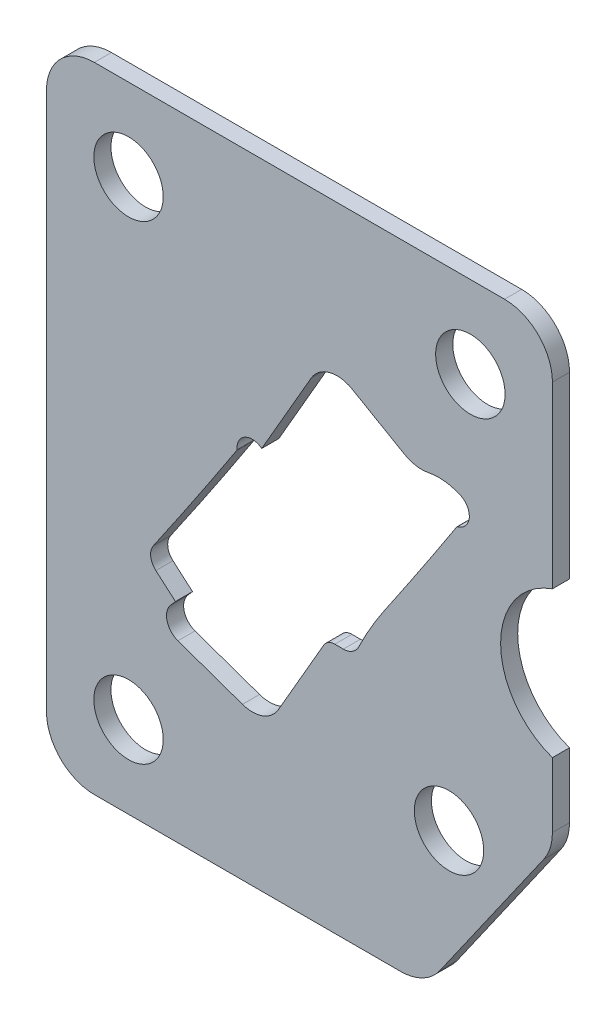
ISO-10303-21;
HEADER;
FILE_DESCRIPTION(('STEP AP214'),'2;1');
FILE_NAME('part.step','',(''),(''),'','','');
FILE_SCHEMA(('AUTOMOTIVE_DESIGN { 1 0 10303 214 1 1 1 1 }'));
ENDSEC;
DATA;
#1=APPLICATION_CONTEXT('core data for automotive mechanical design processes');
#2=APPLICATION_PROTOCOL_DEFINITION('international standard','automotive_design',2000,#1);
#3=PRODUCT_CONTEXT('',#1,'mechanical');
#4=PRODUCT('Part','Part','',(#3));
#5=PRODUCT_RELATED_PRODUCT_CATEGORY('part','',(#4));
#6=PRODUCT_DEFINITION_FORMATION('','',#4);
#7=PRODUCT_DEFINITION_CONTEXT('part definition',#1,'design');
#8=PRODUCT_DEFINITION('design','',#6,#7);
#9=PRODUCT_DEFINITION_SHAPE('','',#8);
#10=(LENGTH_UNIT() NAMED_UNIT(*) SI_UNIT(.MILLI.,.METRE.));
#11=(NAMED_UNIT(*) PLANE_ANGLE_UNIT() SI_UNIT($,.RADIAN.));
#12=(NAMED_UNIT(*) SI_UNIT($,.STERADIAN.) SOLID_ANGLE_UNIT());
#13=UNCERTAINTY_MEASURE_WITH_UNIT(LENGTH_MEASURE(1.E-05),#10,'distance_accuracy_value','');
#14=(GEOMETRIC_REPRESENTATION_CONTEXT(3) GLOBAL_UNCERTAINTY_ASSIGNED_CONTEXT((#13)) GLOBAL_UNIT_ASSIGNED_CONTEXT((#10,
#11,#12)) REPRESENTATION_CONTEXT('',''));
#15=CARTESIAN_POINT('',(0.,0.,0.));
#16=DIRECTION('',(0.,0.,1.));
#17=DIRECTION('',(1.,0.,0.));
#18=AXIS2_PLACEMENT_3D('',#15,#16,#17);
#19=CARTESIAN_POINT('',(-1055.37,51.4350000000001,-31.75));
#20=DIRECTION('',(0.,0.,1.));
#21=DIRECTION('',(1.,0.,0.));
#22=AXIS2_PLACEMENT_3D('',#19,#20,#21);
#23=PLANE('',#22);
#24=CARTESIAN_POINT('',(-1111.25,-23.4949999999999,-31.75));
#25=DIRECTION('',(0.,0.,1.));
#26=DIRECTION('',(1.,0.,0.));
#27=AXIS2_PLACEMENT_3D('',#24,#25,#26);
#28=CIRCLE('',#27,5.15620000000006);
#29=CARTESIAN_POINT('',(-1106.0938,-23.4949999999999,-31.75));
#30=VERTEX_POINT('',#29);
#31=EDGE_CURVE('E537',#30,#30,#28,.T.);
#32=ORIENTED_EDGE('',*,*,#31,.T.);
#33=EDGE_LOOP('',(#32));
#34=FACE_BOUND('',#33,.T.);
#35=CARTESIAN_POINT('',(-1063.625,-13.9699999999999,-31.75));
#36=DIRECTION('',(0.,0.,1.));
#37=DIRECTION('',(1.,0.,0.));
#38=AXIS2_PLACEMENT_3D('',#35,#36,#37);
#39=CIRCLE('',#38,5.15620000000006);
#40=CARTESIAN_POINT('',(-1058.4688,-13.9699999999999,-31.75));
#41=VERTEX_POINT('',#40);
#42=EDGE_CURVE('E545',#41,#41,#39,.T.);
#43=ORIENTED_EDGE('',*,*,#42,.T.);
#44=EDGE_LOOP('',(#43));
#45=FACE_BOUND('',#44,.T.);
#46=CARTESIAN_POINT('',(-1060.45,46.3550000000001,-31.75));
#47=DIRECTION('',(0.,0.,1.));
#48=DIRECTION('',(1.,0.,0.));
#49=AXIS2_PLACEMENT_3D('',#46,#47,#48);
#50=CIRCLE('',#49,5.15620000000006);
#51=CARTESIAN_POINT('',(-1055.2938,46.3550000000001,-31.75));
#52=VERTEX_POINT('',#51);
#53=EDGE_CURVE('E553',#52,#52,#50,.T.);
#54=ORIENTED_EDGE('',*,*,#53,.T.);
#55=EDGE_LOOP('',(#54));
#56=FACE_BOUND('',#55,.T.);
#57=CARTESIAN_POINT('',(-1111.25,46.3550000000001,-31.75));
#58=DIRECTION('',(0.,0.,1.));
#59=DIRECTION('',(1.,0.,0.));
#60=AXIS2_PLACEMENT_3D('',#57,#58,#59);
#61=CIRCLE('',#60,5.15620000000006);
#62=CARTESIAN_POINT('',(-1106.0938,46.3550000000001,-31.75));
#63=VERTEX_POINT('',#62);
#64=EDGE_CURVE('E561',#63,#63,#61,.T.);
#65=ORIENTED_EDGE('',*,*,#64,.T.);
#66=EDGE_LOOP('',(#65));
#67=FACE_BOUND('',#66,.T.);
#68=DIRECTION('',(0.,1.,0.));
#69=VECTOR('',#68,1.);
#70=CARTESIAN_POINT('',(-1048.258,-6.53371920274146,-31.75));
#71=LINE('',#70,#69);
#72=CARTESIAN_POINT('',(-1048.258,24.8304609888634,-31.75));
#73=VERTEX_POINT('',#72);
#74=CARTESIAN_POINT('',(-1048.258,51.435,-31.75));
#75=VERTEX_POINT('',#74);
#76=EDGE_CURVE('E616',#73,#75,#71,.T.);
#77=ORIENTED_EDGE('',*,*,#76,.F.);
#78=CARTESIAN_POINT('',(-1044.448,13.9700000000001,-31.75));
#79=DIRECTION('',(0.,0.,1.));
#80=DIRECTION('',(1.,0.,0.));
#81=AXIS2_PLACEMENT_3D('',#78,#79,#80);
#82=CIRCLE('',#81,11.509375);
#83=CARTESIAN_POINT('',(-1048.258,3.10953901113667,-31.75));
#84=VERTEX_POINT('',#83);
#85=EDGE_CURVE('E566',#73,#84,#82,.T.);
#86=ORIENTED_EDGE('',*,*,#85,.T.);
#87=CARTESIAN_POINT('',(-1048.258,-6.53371920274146,-31.75));
#88=VERTEX_POINT('',#87);
#89=EDGE_CURVE('E617',#88,#84,#71,.T.);
#90=ORIENTED_EDGE('',*,*,#89,.F.);
#91=CARTESIAN_POINT('',(-1055.37,-6.53371920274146,-31.75));
#92=DIRECTION('',(0.,0.,1.));
#93=DIRECTION('',(1.,0.,0.));
#94=AXIS2_PLACEMENT_3D('',#91,#92,#93);
#95=CIRCLE('',#94,7.11200000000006);
#96=CARTESIAN_POINT('',(-1049.54419066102,-10.6129948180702,-31.75));
#97=VERTEX_POINT('',#96);
#98=EDGE_CURVE('E612',#97,#88,#95,.T.);
#99=ORIENTED_EDGE('',*,*,#98,.F.);
#100=DIRECTION('',(0.573576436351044,0.819152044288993,0.));
#101=VECTOR('',#100,1.);
#102=CARTESIAN_POINT('',(-1064.97766162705,-32.6542756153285,-31.75));
#103=LINE('',#102,#101);
#104=CARTESIAN_POINT('',(-1064.97766162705,-32.6542756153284,-31.75));
#105=VERTEX_POINT('',#104);
#106=EDGE_CURVE('E608',#105,#97,#103,.T.);
#107=ORIENTED_EDGE('',*,*,#106,.F.);
#108=CARTESIAN_POINT('',(-1070.80347096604,-28.5749999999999,-31.75));
#109=DIRECTION('',(0.,0.,1.));
#110=DIRECTION('',(1.,0.,0.));
#111=AXIS2_PLACEMENT_3D('',#108,#109,#110);
#112=CIRCLE('',#111,7.11200000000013);
#113=CARTESIAN_POINT('',(-1070.80347096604,-35.687,-31.75));
#114=VERTEX_POINT('',#113);
#115=EDGE_CURVE('E604',#114,#105,#112,.T.);
#116=ORIENTED_EDGE('',*,*,#115,.F.);
#117=DIRECTION('',(1.,0.,0.));
#118=VECTOR('',#117,1.);
#119=CARTESIAN_POINT('',(-1116.33,-35.6869999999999,-31.75));
#120=LINE('',#119,#118);
#121=CARTESIAN_POINT('',(-1116.33,-35.6869999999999,-31.75));
#122=VERTEX_POINT('',#121);
#123=EDGE_CURVE('E600',#122,#114,#120,.T.);
#124=ORIENTED_EDGE('',*,*,#123,.F.);
#125=CARTESIAN_POINT('',(-1116.33,-28.5749999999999,-31.75));
#126=DIRECTION('',(0.,0.,1.));
#127=DIRECTION('',(1.,0.,0.));
#128=AXIS2_PLACEMENT_3D('',#125,#126,#127);
#129=CIRCLE('',#128,7.11199999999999);
#130=CARTESIAN_POINT('',(-1123.442,-28.5749999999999,-31.75));
#131=VERTEX_POINT('',#130);
#132=EDGE_CURVE('E596',#131,#122,#129,.T.);
#133=ORIENTED_EDGE('',*,*,#132,.F.);
#134=DIRECTION('',(0.,-1.,0.));
#135=VECTOR('',#134,1.);
#136=CARTESIAN_POINT('',(-1123.442,51.435,-31.75));
#137=LINE('',#136,#135);
#138=CARTESIAN_POINT('',(-1123.442,51.435,-31.75));
#139=VERTEX_POINT('',#138);
#140=EDGE_CURVE('E592',#139,#131,#137,.T.);
#141=ORIENTED_EDGE('',*,*,#140,.F.);
#142=CARTESIAN_POINT('',(-1116.33,51.4350000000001,-31.75));
#143=DIRECTION('',(0.,0.,1.));
#144=DIRECTION('',(1.,0.,0.));
#145=AXIS2_PLACEMENT_3D('',#142,#143,#144);
#146=CIRCLE('',#145,7.112);
#147=CARTESIAN_POINT('',(-1116.33,58.5470000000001,-31.75));
#148=VERTEX_POINT('',#147);
#149=EDGE_CURVE('E588',#148,#139,#146,.T.);
#150=ORIENTED_EDGE('',*,*,#149,.F.);
#151=DIRECTION('',(-1.,0.,0.));
#152=VECTOR('',#151,1.);
#153=CARTESIAN_POINT('',(-1055.37,58.5470000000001,-31.75));
#154=LINE('',#153,#152);
#155=CARTESIAN_POINT('',(-1055.37,58.5470000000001,-31.75));
#156=VERTEX_POINT('',#155);
#157=EDGE_CURVE('E583',#156,#148,#154,.T.);
#158=ORIENTED_EDGE('',*,*,#157,.F.);
#159=CARTESIAN_POINT('',(-1055.37,51.4350000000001,-31.75));
#160=DIRECTION('',(0.,0.,1.));
#161=DIRECTION('',(1.,0.,0.));
#162=AXIS2_PLACEMENT_3D('',#159,#160,#161);
#163=CIRCLE('',#162,7.112);
#164=EDGE_CURVE('E579',#75,#156,#163,.T.);
#165=ORIENTED_EDGE('',*,*,#164,.F.);
#166=EDGE_LOOP('',(#77,#86,#90,#99,#107,#116,#124,#133,#141,#150,#158,#165));
#167=FACE_BOUND('',#166,.T.);
#168=DIRECTION('',(-0.500000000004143,-0.866025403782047,0.));
#169=VECTOR('',#168,1.);
#170=CARTESIAN_POINT('',(-1084.10623761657,34.0288101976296,-31.75));
#171=LINE('',#170,#169);
#172=CARTESIAN_POINT('',(-1084.10623761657,34.0288101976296,-31.75));
#173=VERTEX_POINT('',#172);
#174=CARTESIAN_POINT('',(-1091.45990883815,21.2918780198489,-31.75));
#175=VERTEX_POINT('',#174);
#176=EDGE_CURVE('E286',#173,#175,#171,.T.);
#177=ORIENTED_EDGE('',*,*,#176,.T.);
#178=CARTESIAN_POINT('',(-1092.86886531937,19.5120629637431,-31.75));
#179=DIRECTION('',(0.,0.,1.));
#180=DIRECTION('',(1.,0.,0.));
#181=AXIS2_PLACEMENT_3D('',#178,#179,#180);
#182=CIRCLE('',#181,2.26999999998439);
#183=CARTESIAN_POINT('',(-1095.13235073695,19.3402090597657,-31.75));
#184=VERTEX_POINT('',#183);
#185=EDGE_CURVE('E279',#175,#184,#182,.T.);
#186=ORIENTED_EDGE('',*,*,#185,.T.);
#187=CARTESIAN_POINT('',(-1095.38562179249,19.3209795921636,-31.75));
#188=DIRECTION('',(0.,0.,-1.));
#189=DIRECTION('',(1.,0.,0.));
#190=AXIS2_PLACEMENT_3D('',#187,#188,#189);
#191=CIRCLE('',#190,0.254000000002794);
#192=CARTESIAN_POINT('',(-1095.1729117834,19.1821615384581,-31.75));
#193=VERTEX_POINT('',#192);
#194=EDGE_CURVE('E289',#184,#193,#191,.T.);
#195=ORIENTED_EDGE('',*,*,#194,.T.);
#196=CARTESIAN_POINT('',(-1812.92046147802,487.596028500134,-31.75));
#197=DIRECTION('',(0.,0.,-1.));
#198=DIRECTION('',(1.,0.,0.));
#199=AXIS2_PLACEMENT_3D('',#196,#197,#198);
#200=CIRCLE('',#199,857.072398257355);
#201=CARTESIAN_POINT('',(-1107.56637726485,0.719543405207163,-31.75));
#202=VERTEX_POINT('',#201);
#203=EDGE_CURVE('E65',#193,#202,#200,.T.);
#204=ORIENTED_EDGE('',*,*,#203,.T.);
#205=CARTESIAN_POINT('',(-1105.69821096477,-0.56997382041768,-31.75));
#206=DIRECTION('',(0.,0.,1.));
#207=DIRECTION('',(1.,0.,0.));
#208=AXIS2_PLACEMENT_3D('',#205,#206,#207);
#209=CIRCLE('',#208,2.26999999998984);
#210=CARTESIAN_POINT('',(-1107.18662755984,-2.28389214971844,-31.75));
#211=VERTEX_POINT('',#210);
#212=EDGE_CURVE('E307',#202,#211,#209,.T.);
#213=ORIENTED_EDGE('',*,*,#212,.T.);
#214=DIRECTION('',(0.755030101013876,-0.655690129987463,0.));
#215=VECTOR('',#214,1.);
#216=CARTESIAN_POINT('',(-1107.18662755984,-2.28389214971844,-31.75));
#217=LINE('',#216,#215);
#218=CARTESIAN_POINT('',(-1104.27812448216,-4.8097209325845,-31.75));
#219=VERTEX_POINT('',#218);
#220=EDGE_CURVE('E311',#211,#219,#217,.T.);
#221=ORIENTED_EDGE('',*,*,#220,.T.);
#222=DIRECTION('',(-0.655690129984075,-0.755030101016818,0.));
#223=VECTOR('',#222,1.);
#224=CARTESIAN_POINT('',(-1104.27812448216,-4.8097209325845,-31.75));
#225=LINE('',#224,#223);
#226=CARTESIAN_POINT('',(-1104.98152565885,-5.61969051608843,-31.75));
#227=VERTEX_POINT('',#226);
#228=EDGE_CURVE('E315',#219,#227,#225,.T.);
#229=ORIENTED_EDGE('',*,*,#228,.T.);
#230=CARTESIAN_POINT('',(-1103.06374920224,-7.285143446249,-31.75));
#231=DIRECTION('',(0.,0.,1.));
#232=DIRECTION('',(1.,0.,0.));
#233=AXIS2_PLACEMENT_3D('',#230,#231,#232);
#234=CIRCLE('',#233,2.54000000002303);
#235=CARTESIAN_POINT('',(-1103.90810029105,-9.68069583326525,-31.75));
#236=VERTEX_POINT('',#235);
#237=EDGE_CURVE('E319',#227,#236,#234,.T.);
#238=ORIENTED_EDGE('',*,*,#237,.T.);
#239=DIRECTION('',(0.943130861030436,-0.332421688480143,0.));
#240=VECTOR('',#239,1.);
#241=CARTESIAN_POINT('',(-1103.90810029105,-9.68069583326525,-31.75));
#242=LINE('',#241,#240);
#243=CARTESIAN_POINT('',(-1094.31656153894,-13.0613884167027,-31.75));
#244=VERTEX_POINT('',#243);
#245=EDGE_CURVE('E323',#236,#244,#242,.T.);
#246=ORIENTED_EDGE('',*,*,#245,.T.);
#247=CARTESIAN_POINT('',(-1092.83894713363,-8.86917173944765,-31.75));
#248=DIRECTION('',(0.,0.,1.));
#249=DIRECTION('',(1.,0.,0.));
#250=AXIS2_PLACEMENT_3D('',#247,#248,#249);
#251=CIRCLE('',#250,4.44499999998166);
#252=CARTESIAN_POINT('',(-1088.98946421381,-11.0916717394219,-31.75));
#253=VERTEX_POINT('',#252);
#254=EDGE_CURVE('E327',#244,#253,#251,.T.);
#255=ORIENTED_EDGE('',*,*,#254,.T.);
#256=DIRECTION('',(0.499999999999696,0.866025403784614,0.));
#257=VECTOR('',#256,1.);
#258=CARTESIAN_POINT('',(-1088.98946421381,-11.0916717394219,-31.75));
#259=LINE('',#258,#257);
#260=CARTESIAN_POINT('',(-1082.24588369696,0.588552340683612,-31.75));
#261=VERTEX_POINT('',#260);
#262=EDGE_CURVE('E331',#253,#261,#259,.T.);
#263=ORIENTED_EDGE('',*,*,#262,.T.);
#264=CARTESIAN_POINT('',(-1080.59610530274,-0.363947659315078,-31.75));
#265=DIRECTION('',(0.,0.,-1.));
#266=DIRECTION('',(1.,0.,0.));
#267=AXIS2_PLACEMENT_3D('',#264,#265,#266);
#268=CIRCLE('',#267,1.90500000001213);
#269=CARTESIAN_POINT('',(-1080.59610530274,1.54105234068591,-31.75));
#270=VERTEX_POINT('',#269);
#271=EDGE_CURVE('E335',#261,#270,#268,.T.);
#272=ORIENTED_EDGE('',*,*,#271,.T.);
#273=DIRECTION('',(1.,0.,0.));
#274=VECTOR('',#273,1.);
#275=CARTESIAN_POINT('',(-1080.59610530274,1.54105234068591,-31.75));
#276=LINE('',#275,#274);
#277=CARTESIAN_POINT('',(-1079.32610530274,1.54105234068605,-31.75));
#278=VERTEX_POINT('',#277);
#279=EDGE_CURVE('E339',#270,#278,#276,.T.);
#280=ORIENTED_EDGE('',*,*,#279,.T.);
#281=CARTESIAN_POINT('',(-1079.32610530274,4.08105234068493,-31.75));
#282=DIRECTION('',(0.,0.,1.));
#283=DIRECTION('',(1.,0.,0.));
#284=AXIS2_PLACEMENT_3D('',#281,#282,#283);
#285=CIRCLE('',#284,2.53999999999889);
#286=CARTESIAN_POINT('',(-1077.04152238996,2.97097085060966,-31.75));
#287=VERTEX_POINT('',#286);
#288=EDGE_CURVE('E343',#278,#287,#285,.T.);
#289=ORIENTED_EDGE('',*,*,#288,.T.);
#290=CARTESIAN_POINT('',(-1030.09012737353,-19.8427665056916,-31.75));
#291=DIRECTION('',(0.,0.,-1.));
#292=DIRECTION('',(1.,0.,0.));
#293=AXIS2_PLACEMENT_3D('',#290,#291,#292);
#294=CIRCLE('',#293,52.2005757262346);
#295=CARTESIAN_POINT('',(-1073.3997555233,9.29786175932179,-31.75));
#296=VERTEX_POINT('',#295);
#297=EDGE_CURVE('E347',#287,#296,#294,.T.);
#298=ORIENTED_EDGE('',*,*,#297,.T.);
#299=CARTESIAN_POINT('',(-1773.16946147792,487.596028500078,-31.75));
#300=DIRECTION('',(0.,0.,1.));
#301=DIRECTION('',(1.,0.,0.));
#302=AXIS2_PLACEMENT_3D('',#299,#300,#301);
#303=CIRCLE('',#302,847.612398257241);
#304=CARTESIAN_POINT('',(-1062.48289720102,25.6746228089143,-31.75));
#305=VERTEX_POINT('',#304);
#306=EDGE_CURVE('E351',#296,#305,#303,.T.);
#307=ORIENTED_EDGE('',*,*,#306,.T.);
#308=CARTESIAN_POINT('',(-1062.26992911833,25.5362010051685,-31.75));
#309=DIRECTION('',(0.,0.,-1.));
#310=DIRECTION('',(1.,0.,0.));
#311=AXIS2_PLACEMENT_3D('',#308,#309,#310);
#312=CIRCLE('',#311,0.253999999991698);
#313=CARTESIAN_POINT('',(-1062.33092433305,25.7827686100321,-31.75));
#314=VERTEX_POINT('',#313);
#315=EDGE_CURVE('E355',#305,#314,#312,.T.);
#316=ORIENTED_EDGE('',*,*,#315,.T.);
#317=CARTESIAN_POINT('',(-1062.8760390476,27.9863452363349,-31.75));
#318=DIRECTION('',(0.,0.,1.));
#319=DIRECTION('',(1.,0.,0.));
#320=AXIS2_PLACEMENT_3D('',#317,#318,#319);
#321=CIRCLE('',#320,2.26999999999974);
#322=CARTESIAN_POINT('',(-1062.12144181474,30.1272522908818,-31.75));
#323=VERTEX_POINT('',#322);
#324=EDGE_CURVE('E359',#314,#323,#321,.T.);
#325=ORIENTED_EDGE('',*,*,#324,.T.);
#326=DIRECTION('',(-0.943130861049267,0.332421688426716,0.));
#327=VECTOR('',#326,1.);
#328=CARTESIAN_POINT('',(-1062.12144181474,30.1272522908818,-31.75));
#329=LINE('',#328,#327);
#330=CARTESIAN_POINT('',(-1062.60055229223,30.2961225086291,-31.75));
#331=VERTEX_POINT('',#330);
#332=EDGE_CURVE('E363',#323,#331,#329,.T.);
#333=ORIENTED_EDGE('',*,*,#332,.T.);
#334=CARTESIAN_POINT('',(-1065.13360555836,23.109465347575,-31.75));
#335=DIRECTION('',(0.,0.,1.));
#336=DIRECTION('',(1.,0.,0.));
#337=AXIS2_PLACEMENT_3D('',#334,#335,#336);
#338=CIRCLE('',#337,7.61999999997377);
#339=CARTESIAN_POINT('',(-1066.66752029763,30.5734793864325,-31.75));
#340=VERTEX_POINT('',#339);
#341=EDGE_CURVE('E367',#331,#340,#338,.T.);
#342=ORIENTED_EDGE('',*,*,#341,.T.);
#343=CARTESIAN_POINT('',(-1067.69013012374,35.5494887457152,-31.75));
#344=DIRECTION('',(0.,0.,-1.));
#345=DIRECTION('',(1.,0.,0.));
#346=AXIS2_PLACEMENT_3D('',#343,#344,#345);
#347=CIRCLE('',#346,5.08000000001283);
#348=CARTESIAN_POINT('',(-1070.23013012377,31.1500796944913,-31.75));
#349=VERTEX_POINT('',#348);
#350=EDGE_CURVE('E371',#340,#349,#347,.T.);
#351=ORIENTED_EDGE('',*,*,#350,.T.);
#352=DIRECTION('',(-0.866025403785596,0.499999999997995,0.));
#353=VECTOR('',#352,1.);
#354=CARTESIAN_POINT('',(-1070.23013012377,31.1500796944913,-31.75));
#355=LINE('',#354,#353);
#356=CARTESIAN_POINT('',(-1078.0342546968,35.6557931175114,-31.75));
#357=VERTEX_POINT('',#356);
#358=EDGE_CURVE('E375',#349,#357,#355,.T.);
#359=ORIENTED_EDGE('',*,*,#358,.T.);
#360=CARTESIAN_POINT('',(-1080.25675469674,31.806310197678,-31.75));
#361=DIRECTION('',(0.,0.,1.));
#362=DIRECTION('',(1.,0.,0.));
#363=AXIS2_PLACEMENT_3D('',#360,#361,#362);
#364=CIRCLE('',#363,4.44499999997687);
#365=EDGE_CURVE('E379',#357,#173,#364,.T.);
#366=ORIENTED_EDGE('',*,*,#365,.T.);
#367=EDGE_LOOP('',(#177,#186,#195,#204,#213,#221,#229,#238,#246,#255,#263,#272,#280,#289,#298,
#307,#316,#325,#333,#342,#351,#359,#366));
#368=FACE_BOUND('',#367,.T.);
#369=ADVANCED_FACE('F47',(#34,#45,#56,#67,#167,#368),#23,.F.);
#370=CARTESIAN_POINT('',(-1055.37,51.4350000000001,-29.21));
#371=DIRECTION('',(0.,0.,1.));
#372=DIRECTION('',(1.,0.,0.));
#373=AXIS2_PLACEMENT_3D('',#370,#371,#372);
#374=PLANE('',#373);
#375=CARTESIAN_POINT('',(-1044.448,13.9700000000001,-29.21));
#376=DIRECTION('',(0.,0.,1.));
#377=DIRECTION('',(1.,0.,0.));
#378=AXIS2_PLACEMENT_3D('',#375,#376,#377);
#379=CIRCLE('',#378,11.509375);
#380=CARTESIAN_POINT('',(-1048.258,24.8304609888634,-29.21));
#381=VERTEX_POINT('',#380);
#382=CARTESIAN_POINT('',(-1048.258,3.10953901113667,-29.21));
#383=VERTEX_POINT('',#382);
#384=EDGE_CURVE('E565',#381,#383,#379,.T.);
#385=ORIENTED_EDGE('',*,*,#384,.F.);
#386=DIRECTION('',(0.,1.,0.));
#387=VECTOR('',#386,1.);
#388=CARTESIAN_POINT('',(-1048.258,-6.53371920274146,-29.21));
#389=LINE('',#388,#387);
#390=CARTESIAN_POINT('',(-1048.258,51.435,-29.21));
#391=VERTEX_POINT('',#390);
#392=EDGE_CURVE('E656',#381,#391,#389,.T.);
#393=ORIENTED_EDGE('',*,*,#392,.T.);
#394=CARTESIAN_POINT('',(-1055.37,51.4350000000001,-29.21));
#395=DIRECTION('',(0.,0.,1.));
#396=DIRECTION('',(1.,0.,0.));
#397=AXIS2_PLACEMENT_3D('',#394,#395,#396);
#398=CIRCLE('',#397,7.112);
#399=CARTESIAN_POINT('',(-1055.37,58.5470000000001,-29.21));
#400=VERTEX_POINT('',#399);
#401=EDGE_CURVE('E578',#391,#400,#398,.T.);
#402=ORIENTED_EDGE('',*,*,#401,.T.);
#403=DIRECTION('',(-1.,0.,0.));
#404=VECTOR('',#403,1.);
#405=CARTESIAN_POINT('',(-1055.37,58.5470000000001,-29.21));
#406=LINE('',#405,#404);
#407=CARTESIAN_POINT('',(-1116.33,58.5470000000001,-29.21));
#408=VERTEX_POINT('',#407);
#409=EDGE_CURVE('E624',#400,#408,#406,.T.);
#410=ORIENTED_EDGE('',*,*,#409,.T.);
#411=CARTESIAN_POINT('',(-1116.33,51.4350000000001,-29.21));
#412=DIRECTION('',(0.,0.,1.));
#413=DIRECTION('',(1.,0.,0.));
#414=AXIS2_PLACEMENT_3D('',#411,#412,#413);
#415=CIRCLE('',#414,7.112);
#416=CARTESIAN_POINT('',(-1123.442,51.435,-29.21));
#417=VERTEX_POINT('',#416);
#418=EDGE_CURVE('E628',#408,#417,#415,.T.);
#419=ORIENTED_EDGE('',*,*,#418,.T.);
#420=DIRECTION('',(0.,-1.,0.));
#421=VECTOR('',#420,1.);
#422=CARTESIAN_POINT('',(-1123.442,51.435,-29.21));
#423=LINE('',#422,#421);
#424=CARTESIAN_POINT('',(-1123.442,-28.5749999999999,-29.21));
#425=VERTEX_POINT('',#424);
#426=EDGE_CURVE('E632',#417,#425,#423,.T.);
#427=ORIENTED_EDGE('',*,*,#426,.T.);
#428=CARTESIAN_POINT('',(-1116.33,-28.5749999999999,-29.21));
#429=DIRECTION('',(0.,0.,1.));
#430=DIRECTION('',(1.,0.,0.));
#431=AXIS2_PLACEMENT_3D('',#428,#429,#430);
#432=CIRCLE('',#431,7.11199999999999);
#433=CARTESIAN_POINT('',(-1116.33,-35.6869999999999,-29.21));
#434=VERTEX_POINT('',#433);
#435=EDGE_CURVE('E636',#425,#434,#432,.T.);
#436=ORIENTED_EDGE('',*,*,#435,.T.);
#437=DIRECTION('',(1.,0.,0.));
#438=VECTOR('',#437,1.);
#439=CARTESIAN_POINT('',(-1116.33,-35.6869999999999,-29.21));
#440=LINE('',#439,#438);
#441=CARTESIAN_POINT('',(-1070.80347096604,-35.687,-29.21));
#442=VERTEX_POINT('',#441);
#443=EDGE_CURVE('E640',#434,#442,#440,.T.);
#444=ORIENTED_EDGE('',*,*,#443,.T.);
#445=CARTESIAN_POINT('',(-1070.80347096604,-28.5749999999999,-29.21));
#446=DIRECTION('',(0.,0.,1.));
#447=DIRECTION('',(1.,0.,0.));
#448=AXIS2_PLACEMENT_3D('',#445,#446,#447);
#449=CIRCLE('',#448,7.11200000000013);
#450=CARTESIAN_POINT('',(-1064.97766162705,-32.6542756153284,-29.21));
#451=VERTEX_POINT('',#450);
#452=EDGE_CURVE('E644',#442,#451,#449,.T.);
#453=ORIENTED_EDGE('',*,*,#452,.T.);
#454=DIRECTION('',(0.573576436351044,0.819152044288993,0.));
#455=VECTOR('',#454,1.);
#456=CARTESIAN_POINT('',(-1064.97766162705,-32.6542756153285,-29.21));
#457=LINE('',#456,#455);
#458=CARTESIAN_POINT('',(-1049.54419066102,-10.6129948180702,-29.21));
#459=VERTEX_POINT('',#458);
#460=EDGE_CURVE('E648',#451,#459,#457,.T.);
#461=ORIENTED_EDGE('',*,*,#460,.T.);
#462=CARTESIAN_POINT('',(-1055.37,-6.53371920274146,-29.21));
#463=DIRECTION('',(0.,0.,1.));
#464=DIRECTION('',(1.,0.,0.));
#465=AXIS2_PLACEMENT_3D('',#462,#463,#464);
#466=CIRCLE('',#465,7.11200000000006);
#467=CARTESIAN_POINT('',(-1048.258,-6.53371920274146,-29.21));
#468=VERTEX_POINT('',#467);
#469=EDGE_CURVE('E652',#459,#468,#466,.T.);
#470=ORIENTED_EDGE('',*,*,#469,.T.);
#471=EDGE_CURVE('E584',#468,#383,#389,.T.);
#472=ORIENTED_EDGE('',*,*,#471,.T.);
#473=EDGE_LOOP('',(#385,#393,#402,#410,#419,#427,#436,#444,#453,#461,#470,#472));
#474=FACE_BOUND('',#473,.T.);
#475=CARTESIAN_POINT('',(-1111.25,46.3550000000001,-29.21));
#476=DIRECTION('',(0.,0.,1.));
#477=DIRECTION('',(1.,0.,0.));
#478=AXIS2_PLACEMENT_3D('',#475,#476,#477);
#479=CIRCLE('',#478,5.15620000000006);
#480=CARTESIAN_POINT('',(-1106.0938,46.3550000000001,-29.21));
#481=VERTEX_POINT('',#480);
#482=EDGE_CURVE('E557',#481,#481,#479,.T.);
#483=ORIENTED_EDGE('',*,*,#482,.F.);
#484=EDGE_LOOP('',(#483));
#485=FACE_BOUND('',#484,.T.);
#486=CARTESIAN_POINT('',(-1060.45,46.3550000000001,-29.21));
#487=DIRECTION('',(0.,0.,1.));
#488=DIRECTION('',(1.,0.,0.));
#489=AXIS2_PLACEMENT_3D('',#486,#487,#488);
#490=CIRCLE('',#489,5.15620000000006);
#491=CARTESIAN_POINT('',(-1055.2938,46.3550000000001,-29.21));
#492=VERTEX_POINT('',#491);
#493=EDGE_CURVE('E549',#492,#492,#490,.T.);
#494=ORIENTED_EDGE('',*,*,#493,.F.);
#495=EDGE_LOOP('',(#494));
#496=FACE_BOUND('',#495,.T.);
#497=CARTESIAN_POINT('',(-1063.625,-13.9699999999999,-29.21));
#498=DIRECTION('',(0.,0.,1.));
#499=DIRECTION('',(1.,0.,0.));
#500=AXIS2_PLACEMENT_3D('',#497,#498,#499);
#501=CIRCLE('',#500,5.15620000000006);
#502=CARTESIAN_POINT('',(-1058.4688,-13.9699999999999,-29.21));
#503=VERTEX_POINT('',#502);
#504=EDGE_CURVE('E541',#503,#503,#501,.T.);
#505=ORIENTED_EDGE('',*,*,#504,.F.);
#506=EDGE_LOOP('',(#505));
#507=FACE_BOUND('',#506,.T.);
#508=CARTESIAN_POINT('',(-1111.25,-23.4949999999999,-29.21));
#509=DIRECTION('',(0.,0.,1.));
#510=DIRECTION('',(1.,0.,0.));
#511=AXIS2_PLACEMENT_3D('',#508,#509,#510);
#512=CIRCLE('',#511,5.15620000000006);
#513=CARTESIAN_POINT('',(-1106.0938,-23.4949999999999,-29.21));
#514=VERTEX_POINT('',#513);
#515=EDGE_CURVE('E471',#514,#514,#512,.T.);
#516=ORIENTED_EDGE('',*,*,#515,.F.);
#517=EDGE_LOOP('',(#516));
#518=FACE_BOUND('',#517,.T.);
#519=CARTESIAN_POINT('',(-1092.86886531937,19.5120629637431,-29.21));
#520=DIRECTION('',(0.,0.,1.));
#521=DIRECTION('',(1.,0.,0.));
#522=AXIS2_PLACEMENT_3D('',#519,#520,#521);
#523=CIRCLE('',#522,2.26999999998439);
#524=CARTESIAN_POINT('',(-1091.45990883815,21.2918780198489,-29.21));
#525=VERTEX_POINT('',#524);
#526=CARTESIAN_POINT('',(-1095.13235073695,19.3402090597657,-29.21));
#527=VERTEX_POINT('',#526);
#528=EDGE_CURVE('E73',#525,#527,#523,.T.);
#529=ORIENTED_EDGE('',*,*,#528,.F.);
#530=DIRECTION('',(-0.500000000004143,-0.866025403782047,0.));
#531=VECTOR('',#530,1.);
#532=CARTESIAN_POINT('',(-1084.10623761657,34.0288101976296,-29.21));
#533=LINE('',#532,#531);
#534=CARTESIAN_POINT('',(-1084.10623761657,34.0288101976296,-29.21));
#535=VERTEX_POINT('',#534);
#536=EDGE_CURVE('E297',#535,#525,#533,.T.);
#537=ORIENTED_EDGE('',*,*,#536,.F.);
#538=CARTESIAN_POINT('',(-1080.25675469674,31.806310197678,-29.21));
#539=DIRECTION('',(0.,0.,1.));
#540=DIRECTION('',(1.,0.,0.));
#541=AXIS2_PLACEMENT_3D('',#538,#539,#540);
#542=CIRCLE('',#541,4.44499999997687);
#543=CARTESIAN_POINT('',(-1078.0342546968,35.6557931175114,-29.21));
#544=VERTEX_POINT('',#543);
#545=EDGE_CURVE('E302',#544,#535,#542,.T.);
#546=ORIENTED_EDGE('',*,*,#545,.F.);
#547=DIRECTION('',(-0.866025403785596,0.499999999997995,0.));
#548=VECTOR('',#547,1.);
#549=CARTESIAN_POINT('',(-1070.23013012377,31.1500796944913,-29.21));
#550=LINE('',#549,#548);
#551=CARTESIAN_POINT('',(-1070.23013012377,31.1500796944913,-29.21));
#552=VERTEX_POINT('',#551);
#553=EDGE_CURVE('E461',#552,#544,#550,.T.);
#554=ORIENTED_EDGE('',*,*,#553,.F.);
#555=CARTESIAN_POINT('',(-1067.69013012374,35.5494887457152,-29.21));
#556=DIRECTION('',(0.,0.,-1.));
#557=DIRECTION('',(1.,0.,0.));
#558=AXIS2_PLACEMENT_3D('',#555,#556,#557);
#559=CIRCLE('',#558,5.08000000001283);
#560=CARTESIAN_POINT('',(-1066.66752029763,30.5734793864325,-29.21));
#561=VERTEX_POINT('',#560);
#562=EDGE_CURVE('E457',#561,#552,#559,.T.);
#563=ORIENTED_EDGE('',*,*,#562,.F.);
#564=CARTESIAN_POINT('',(-1065.13360555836,23.109465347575,-29.21));
#565=DIRECTION('',(0.,0.,1.));
#566=DIRECTION('',(1.,0.,0.));
#567=AXIS2_PLACEMENT_3D('',#564,#565,#566);
#568=CIRCLE('',#567,7.61999999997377);
#569=CARTESIAN_POINT('',(-1062.60055229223,30.2961225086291,-29.21));
#570=VERTEX_POINT('',#569);
#571=EDGE_CURVE('E453',#570,#561,#568,.T.);
#572=ORIENTED_EDGE('',*,*,#571,.F.);
#573=DIRECTION('',(-0.943130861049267,0.332421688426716,0.));
#574=VECTOR('',#573,1.);
#575=CARTESIAN_POINT('',(-1062.12144181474,30.1272522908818,-29.21));
#576=LINE('',#575,#574);
#577=CARTESIAN_POINT('',(-1062.12144181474,30.1272522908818,-29.21));
#578=VERTEX_POINT('',#577);
#579=EDGE_CURVE('E449',#578,#570,#576,.T.);
#580=ORIENTED_EDGE('',*,*,#579,.F.);
#581=CARTESIAN_POINT('',(-1062.8760390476,27.9863452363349,-29.21));
#582=DIRECTION('',(0.,0.,1.));
#583=DIRECTION('',(1.,0.,0.));
#584=AXIS2_PLACEMENT_3D('',#581,#582,#583);
#585=CIRCLE('',#584,2.26999999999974);
#586=CARTESIAN_POINT('',(-1062.33092433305,25.7827686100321,-29.21));
#587=VERTEX_POINT('',#586);
#588=EDGE_CURVE('E445',#587,#578,#585,.T.);
#589=ORIENTED_EDGE('',*,*,#588,.F.);
#590=CARTESIAN_POINT('',(-1062.26992911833,25.5362010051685,-29.21));
#591=DIRECTION('',(0.,0.,-1.));
#592=DIRECTION('',(1.,0.,0.));
#593=AXIS2_PLACEMENT_3D('',#590,#591,#592);
#594=CIRCLE('',#593,0.253999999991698);
#595=CARTESIAN_POINT('',(-1062.48289720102,25.6746228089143,-29.21));
#596=VERTEX_POINT('',#595);
#597=EDGE_CURVE('E441',#596,#587,#594,.T.);
#598=ORIENTED_EDGE('',*,*,#597,.F.);
#599=CARTESIAN_POINT('',(-1773.16946147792,487.596028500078,-29.21));
#600=DIRECTION('',(0.,0.,1.));
#601=DIRECTION('',(1.,0.,0.));
#602=AXIS2_PLACEMENT_3D('',#599,#600,#601);
#603=CIRCLE('',#602,847.612398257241);
#604=CARTESIAN_POINT('',(-1073.3997555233,9.29786175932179,-29.21));
#605=VERTEX_POINT('',#604);
#606=EDGE_CURVE('E437',#605,#596,#603,.T.);
#607=ORIENTED_EDGE('',*,*,#606,.F.);
#608=CARTESIAN_POINT('',(-1030.09012737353,-19.8427665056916,-29.21));
#609=DIRECTION('',(0.,0.,-1.));
#610=DIRECTION('',(1.,0.,0.));
#611=AXIS2_PLACEMENT_3D('',#608,#609,#610);
#612=CIRCLE('',#611,52.2005757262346);
#613=CARTESIAN_POINT('',(-1077.04152238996,2.97097085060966,-29.21));
#614=VERTEX_POINT('',#613);
#615=EDGE_CURVE('E433',#614,#605,#612,.T.);
#616=ORIENTED_EDGE('',*,*,#615,.F.);
#617=CARTESIAN_POINT('',(-1079.32610530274,4.08105234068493,-29.21));
#618=DIRECTION('',(0.,0.,1.));
#619=DIRECTION('',(1.,0.,0.));
#620=AXIS2_PLACEMENT_3D('',#617,#618,#619);
#621=CIRCLE('',#620,2.53999999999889);
#622=CARTESIAN_POINT('',(-1079.32610530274,1.54105234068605,-29.21));
#623=VERTEX_POINT('',#622);
#624=EDGE_CURVE('E429',#623,#614,#621,.T.);
#625=ORIENTED_EDGE('',*,*,#624,.F.);
#626=DIRECTION('',(1.,0.,0.));
#627=VECTOR('',#626,1.);
#628=CARTESIAN_POINT('',(-1080.59610530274,1.54105234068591,-29.21));
#629=LINE('',#628,#627);
#630=CARTESIAN_POINT('',(-1080.59610530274,1.54105234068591,-29.21));
#631=VERTEX_POINT('',#630);
#632=EDGE_CURVE('E425',#631,#623,#629,.T.);
#633=ORIENTED_EDGE('',*,*,#632,.F.);
#634=CARTESIAN_POINT('',(-1080.59610530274,-0.363947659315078,-29.21));
#635=DIRECTION('',(0.,0.,-1.));
#636=DIRECTION('',(1.,0.,0.));
#637=AXIS2_PLACEMENT_3D('',#634,#635,#636);
#638=CIRCLE('',#637,1.90500000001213);
#639=CARTESIAN_POINT('',(-1082.24588369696,0.588552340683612,-29.21));
#640=VERTEX_POINT('',#639);
#641=EDGE_CURVE('E421',#640,#631,#638,.T.);
#642=ORIENTED_EDGE('',*,*,#641,.F.);
#643=DIRECTION('',(0.499999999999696,0.866025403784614,0.));
#644=VECTOR('',#643,1.);
#645=CARTESIAN_POINT('',(-1088.98946421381,-11.0916717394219,-29.21));
#646=LINE('',#645,#644);
#647=CARTESIAN_POINT('',(-1088.98946421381,-11.0916717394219,-29.21));
#648=VERTEX_POINT('',#647);
#649=EDGE_CURVE('E417',#648,#640,#646,.T.);
#650=ORIENTED_EDGE('',*,*,#649,.F.);
#651=CARTESIAN_POINT('',(-1092.83894713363,-8.86917173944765,-29.21));
#652=DIRECTION('',(0.,0.,1.));
#653=DIRECTION('',(1.,0.,0.));
#654=AXIS2_PLACEMENT_3D('',#651,#652,#653);
#655=CIRCLE('',#654,4.44499999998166);
#656=CARTESIAN_POINT('',(-1094.31656153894,-13.0613884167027,-29.21));
#657=VERTEX_POINT('',#656);
#658=EDGE_CURVE('E413',#657,#648,#655,.T.);
#659=ORIENTED_EDGE('',*,*,#658,.F.);
#660=DIRECTION('',(0.943130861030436,-0.332421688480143,0.));
#661=VECTOR('',#660,1.);
#662=CARTESIAN_POINT('',(-1103.90810029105,-9.68069583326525,-29.21));
#663=LINE('',#662,#661);
#664=CARTESIAN_POINT('',(-1103.90810029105,-9.68069583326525,-29.21));
#665=VERTEX_POINT('',#664);
#666=EDGE_CURVE('E409',#665,#657,#663,.T.);
#667=ORIENTED_EDGE('',*,*,#666,.F.);
#668=CARTESIAN_POINT('',(-1103.06374920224,-7.285143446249,-29.21));
#669=DIRECTION('',(0.,0.,1.));
#670=DIRECTION('',(1.,0.,0.));
#671=AXIS2_PLACEMENT_3D('',#668,#669,#670);
#672=CIRCLE('',#671,2.54000000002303);
#673=CARTESIAN_POINT('',(-1104.98152565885,-5.61969051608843,-29.21));
#674=VERTEX_POINT('',#673);
#675=EDGE_CURVE('E405',#674,#665,#672,.T.);
#676=ORIENTED_EDGE('',*,*,#675,.F.);
#677=DIRECTION('',(-0.655690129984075,-0.755030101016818,0.));
#678=VECTOR('',#677,1.);
#679=CARTESIAN_POINT('',(-1104.27812448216,-4.8097209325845,-29.21));
#680=LINE('',#679,#678);
#681=CARTESIAN_POINT('',(-1104.27812448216,-4.8097209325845,-29.21));
#682=VERTEX_POINT('',#681);
#683=EDGE_CURVE('E401',#682,#674,#680,.T.);
#684=ORIENTED_EDGE('',*,*,#683,.F.);
#685=DIRECTION('',(0.755030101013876,-0.655690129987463,0.));
#686=VECTOR('',#685,1.);
#687=CARTESIAN_POINT('',(-1107.18662755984,-2.28389214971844,-29.21));
#688=LINE('',#687,#686);
#689=CARTESIAN_POINT('',(-1107.18662755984,-2.28389214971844,-29.21));
#690=VERTEX_POINT('',#689);
#691=EDGE_CURVE('E397',#690,#682,#688,.T.);
#692=ORIENTED_EDGE('',*,*,#691,.F.);
#693=CARTESIAN_POINT('',(-1105.69821096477,-0.56997382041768,-29.21));
#694=DIRECTION('',(0.,0.,1.));
#695=DIRECTION('',(1.,0.,0.));
#696=AXIS2_PLACEMENT_3D('',#693,#694,#695);
#697=CIRCLE('',#696,2.26999999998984);
#698=CARTESIAN_POINT('',(-1107.56637726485,0.719543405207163,-29.21));
#699=VERTEX_POINT('',#698);
#700=EDGE_CURVE('E393',#699,#690,#697,.T.);
#701=ORIENTED_EDGE('',*,*,#700,.F.);
#702=CARTESIAN_POINT('',(-1812.92046147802,487.596028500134,-29.21));
#703=DIRECTION('',(0.,0.,-1.));
#704=DIRECTION('',(1.,0.,0.));
#705=AXIS2_PLACEMENT_3D('',#702,#703,#704);
#706=CIRCLE('',#705,857.072398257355);
#707=CARTESIAN_POINT('',(-1095.1729117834,19.1821615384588,-29.21));
#708=VERTEX_POINT('',#707);
#709=EDGE_CURVE('E389',#708,#699,#706,.T.);
#710=ORIENTED_EDGE('',*,*,#709,.F.);
#711=CARTESIAN_POINT('',(-1095.38562179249,19.3209795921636,-29.21));
#712=DIRECTION('',(0.,0.,-1.));
#713=DIRECTION('',(1.,0.,0.));
#714=AXIS2_PLACEMENT_3D('',#711,#712,#713);
#715=CIRCLE('',#714,0.254000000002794);
#716=EDGE_CURVE('E386',#527,#708,#715,.T.);
#717=ORIENTED_EDGE('',*,*,#716,.F.);
#718=EDGE_LOOP('',(#529,#537,#546,#554,#563,#572,#580,#589,#598,#607,#616,#625,#633,#642,#650,
#659,#667,#676,#684,#692,#701,#710,#717));
#719=FACE_BOUND('',#718,.T.);
#720=ADVANCED_FACE('F695',(#474,#485,#496,#507,#518,#719),#374,.T.);
#721=CARTESIAN_POINT('',(-1048.258,-6.53371920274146,-31.75));
#722=DIRECTION('',(1.,0.,0.));
#723=DIRECTION('',(0.,0.,-1.));
#724=AXIS2_PLACEMENT_3D('',#721,#722,#723);
#725=PLANE('',#724);
#726=DIRECTION('',(0.,0.,1.));
#727=VECTOR('',#726,1.);
#728=CARTESIAN_POINT('',(-1048.258,24.8304609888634,-31.75));
#729=LINE('',#728,#727);
#730=EDGE_CURVE('E575',#73,#381,#729,.T.);
#731=ORIENTED_EDGE('',*,*,#730,.F.);
#732=ORIENTED_EDGE('',*,*,#76,.T.);
#733=DIRECTION('',(0.,0.,1.));
#734=VECTOR('',#733,1.);
#735=CARTESIAN_POINT('',(-1048.258,51.435,-31.75));
#736=LINE('',#735,#734);
#737=EDGE_CURVE('E11',#75,#391,#736,.T.);
#738=ORIENTED_EDGE('',*,*,#737,.T.);
#739=ORIENTED_EDGE('',*,*,#392,.F.);
#740=EDGE_LOOP('',(#731,#732,#738,#739));
#741=FACE_BOUND('',#740,.T.);
#742=ADVANCED_FACE('F701',(#741),#725,.T.);
#743=CARTESIAN_POINT('',(-1055.37,51.4350000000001,-31.75));
#744=DIRECTION('',(0.,0.,1.));
#745=DIRECTION('',(1.,0.,0.));
#746=AXIS2_PLACEMENT_3D('',#743,#744,#745);
#747=CYLINDRICAL_SURFACE('',#746,7.112);
#748=ORIENTED_EDGE('',*,*,#401,.F.);
#749=ORIENTED_EDGE('',*,*,#737,.F.);
#750=ORIENTED_EDGE('',*,*,#164,.T.);
#751=DIRECTION('',(0.,0.,1.));
#752=VECTOR('',#751,1.);
#753=CARTESIAN_POINT('',(-1055.37,58.5470000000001,-31.75));
#754=LINE('',#753,#752);
#755=EDGE_CURVE('E51',#156,#400,#754,.T.);
#756=ORIENTED_EDGE('',*,*,#755,.T.);
#757=EDGE_LOOP('',(#748,#749,#750,#756));
#758=FACE_BOUND('',#757,.T.);
#759=ADVANCED_FACE('F49',(#758),#747,.T.);
#760=DIRECTION('',(0.,0.,1.));
#761=VECTOR('',#760,1.);
#762=CARTESIAN_POINT('',(-1048.258,3.10953901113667,-31.75));
#763=LINE('',#762,#761);
#764=EDGE_CURVE('E570',#383,#84,#763,.F.);
#765=ORIENTED_EDGE('',*,*,#764,.F.);
#766=ORIENTED_EDGE('',*,*,#471,.F.);
#767=DIRECTION('',(0.,0.,1.));
#768=VECTOR('',#767,1.);
#769=CARTESIAN_POINT('',(-1048.258,-6.53371920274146,-31.75));
#770=LINE('',#769,#768);
#771=EDGE_CURVE('E57',#88,#468,#770,.T.);
#772=ORIENTED_EDGE('',*,*,#771,.F.);
#773=ORIENTED_EDGE('',*,*,#89,.T.);
#774=EDGE_LOOP('',(#765,#766,#772,#773));
#775=FACE_BOUND('',#774,.T.);
#776=ADVANCED_FACE('F734',(#775),#725,.T.);
#777=CARTESIAN_POINT('',(-1055.37,-6.53371920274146,-31.75));
#778=DIRECTION('',(0.,0.,1.));
#779=DIRECTION('',(1.,0.,0.));
#780=AXIS2_PLACEMENT_3D('',#777,#778,#779);
#781=CYLINDRICAL_SURFACE('',#780,7.11200000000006);
#782=ORIENTED_EDGE('',*,*,#469,.F.);
#783=DIRECTION('',(0.,0.,1.));
#784=VECTOR('',#783,1.);
#785=CARTESIAN_POINT('',(-1049.54419066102,-10.6129948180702,-31.75));
#786=LINE('',#785,#784);
#787=EDGE_CURVE('E662',#97,#459,#786,.T.);
#788=ORIENTED_EDGE('',*,*,#787,.F.);
#789=ORIENTED_EDGE('',*,*,#98,.T.);
#790=ORIENTED_EDGE('',*,*,#771,.T.);
#791=EDGE_LOOP('',(#782,#788,#789,#790));
#792=FACE_BOUND('',#791,.T.);
#793=ADVANCED_FACE('F730',(#792),#781,.T.);
#794=CARTESIAN_POINT('',(-1064.97766162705,-32.6542756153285,-31.75));
#795=DIRECTION('',(0.819152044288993,-0.573576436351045,0.));
#796=DIRECTION('',(0.573576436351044,0.819152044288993,0.));
#797=AXIS2_PLACEMENT_3D('',#794,#795,#796);
#798=PLANE('',#797);
#799=ORIENTED_EDGE('',*,*,#460,.F.);
#800=DIRECTION('',(0.,0.,1.));
#801=VECTOR('',#800,1.);
#802=CARTESIAN_POINT('',(-1064.97766162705,-32.6542756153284,-31.75));
#803=LINE('',#802,#801);
#804=EDGE_CURVE('E665',#105,#451,#803,.T.);
#805=ORIENTED_EDGE('',*,*,#804,.F.);
#806=ORIENTED_EDGE('',*,*,#106,.T.);
#807=ORIENTED_EDGE('',*,*,#787,.T.);
#808=EDGE_LOOP('',(#799,#805,#806,#807));
#809=FACE_BOUND('',#808,.T.);
#810=ADVANCED_FACE('F726',(#809),#798,.T.);
#811=CARTESIAN_POINT('',(-1070.80347096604,-28.5749999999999,-31.75));
#812=DIRECTION('',(0.,0.,1.));
#813=DIRECTION('',(1.,0.,0.));
#814=AXIS2_PLACEMENT_3D('',#811,#812,#813);
#815=CYLINDRICAL_SURFACE('',#814,7.11200000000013);
#816=ORIENTED_EDGE('',*,*,#452,.F.);
#817=DIRECTION('',(0.,0.,1.));
#818=VECTOR('',#817,1.);
#819=CARTESIAN_POINT('',(-1070.80347096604,-35.687,-31.75));
#820=LINE('',#819,#818);
#821=EDGE_CURVE('E668',#114,#442,#820,.T.);
#822=ORIENTED_EDGE('',*,*,#821,.F.);
#823=ORIENTED_EDGE('',*,*,#115,.T.);
#824=ORIENTED_EDGE('',*,*,#804,.T.);
#825=EDGE_LOOP('',(#816,#822,#823,#824));
#826=FACE_BOUND('',#825,.T.);
#827=ADVANCED_FACE('F722',(#826),#815,.T.);
#828=CARTESIAN_POINT('',(-1116.33,-35.6869999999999,-31.75));
#829=DIRECTION('',(0.,-1.,0.));
#830=DIRECTION('',(1.,0.,0.));
#831=AXIS2_PLACEMENT_3D('',#828,#829,#830);
#832=PLANE('',#831);
#833=ORIENTED_EDGE('',*,*,#443,.F.);
#834=DIRECTION('',(0.,0.,1.));
#835=VECTOR('',#834,1.);
#836=CARTESIAN_POINT('',(-1116.33,-35.6869999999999,-31.75));
#837=LINE('',#836,#835);
#838=EDGE_CURVE('E671',#122,#434,#837,.T.);
#839=ORIENTED_EDGE('',*,*,#838,.F.);
#840=ORIENTED_EDGE('',*,*,#123,.T.);
#841=ORIENTED_EDGE('',*,*,#821,.T.);
#842=EDGE_LOOP('',(#833,#839,#840,#841));
#843=FACE_BOUND('',#842,.T.);
#844=ADVANCED_FACE('F718',(#843),#832,.T.);
#845=CARTESIAN_POINT('',(-1116.33,-28.5749999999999,-31.75));
#846=DIRECTION('',(0.,0.,1.));
#847=DIRECTION('',(1.,0.,0.));
#848=AXIS2_PLACEMENT_3D('',#845,#846,#847);
#849=CYLINDRICAL_SURFACE('',#848,7.11199999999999);
#850=ORIENTED_EDGE('',*,*,#435,.F.);
#851=DIRECTION('',(0.,0.,1.));
#852=VECTOR('',#851,1.);
#853=CARTESIAN_POINT('',(-1123.442,-28.5749999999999,-31.75));
#854=LINE('',#853,#852);
#855=EDGE_CURVE('E674',#131,#425,#854,.T.);
#856=ORIENTED_EDGE('',*,*,#855,.F.);
#857=ORIENTED_EDGE('',*,*,#132,.T.);
#858=ORIENTED_EDGE('',*,*,#838,.T.);
#859=EDGE_LOOP('',(#850,#856,#857,#858));
#860=FACE_BOUND('',#859,.T.);
#861=ADVANCED_FACE('F714',(#860),#849,.T.);
#862=CARTESIAN_POINT('',(-1123.442,51.435,-31.75));
#863=DIRECTION('',(-1.,0.,0.));
#864=DIRECTION('',(0.,0.,1.));
#865=AXIS2_PLACEMENT_3D('',#862,#863,#864);
#866=PLANE('',#865);
#867=ORIENTED_EDGE('',*,*,#426,.F.);
#868=DIRECTION('',(0.,0.,1.));
#869=VECTOR('',#868,1.);
#870=CARTESIAN_POINT('',(-1123.442,51.435,-31.75));
#871=LINE('',#870,#869);
#872=EDGE_CURVE('E677',#139,#417,#871,.T.);
#873=ORIENTED_EDGE('',*,*,#872,.F.);
#874=ORIENTED_EDGE('',*,*,#140,.T.);
#875=ORIENTED_EDGE('',*,*,#855,.T.);
#876=EDGE_LOOP('',(#867,#873,#874,#875));
#877=FACE_BOUND('',#876,.T.);
#878=ADVANCED_FACE('F712',(#877),#866,.T.);
#879=CARTESIAN_POINT('',(-1116.33,51.4350000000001,-31.75));
#880=DIRECTION('',(0.,0.,1.));
#881=DIRECTION('',(1.,0.,0.));
#882=AXIS2_PLACEMENT_3D('',#879,#880,#881);
#883=CYLINDRICAL_SURFACE('',#882,7.112);
#884=ORIENTED_EDGE('',*,*,#418,.F.);
#885=DIRECTION('',(0.,0.,1.));
#886=VECTOR('',#885,1.);
#887=CARTESIAN_POINT('',(-1116.33,58.5470000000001,-31.75));
#888=LINE('',#887,#886);
#889=EDGE_CURVE('E679',#148,#408,#888,.T.);
#890=ORIENTED_EDGE('',*,*,#889,.F.);
#891=ORIENTED_EDGE('',*,*,#149,.T.);
#892=ORIENTED_EDGE('',*,*,#872,.T.);
#893=EDGE_LOOP('',(#884,#890,#891,#892));
#894=FACE_BOUND('',#893,.T.);
#895=ADVANCED_FACE('F708',(#894),#883,.T.);
#896=CARTESIAN_POINT('',(-1055.37,58.5470000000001,-31.75));
#897=DIRECTION('',(0.,1.,0.));
#898=DIRECTION('',(-1.,0.,0.));
#899=AXIS2_PLACEMENT_3D('',#896,#897,#898);
#900=PLANE('',#899);
#901=ORIENTED_EDGE('',*,*,#409,.F.);
#902=ORIENTED_EDGE('',*,*,#755,.F.);
#903=ORIENTED_EDGE('',*,*,#157,.T.);
#904=ORIENTED_EDGE('',*,*,#889,.T.);
#905=EDGE_LOOP('',(#901,#902,#903,#904));
#906=FACE_BOUND('',#905,.T.);
#907=ADVANCED_FACE('F692',(#906),#900,.T.);
#908=CARTESIAN_POINT('',(-1044.448,13.9700000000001,-31.75));
#909=DIRECTION('',(0.,0.,1.));
#910=DIRECTION('',(1.,0.,0.));
#911=AXIS2_PLACEMENT_3D('',#908,#909,#910);
#912=CYLINDRICAL_SURFACE('',#911,11.509375);
#913=ORIENTED_EDGE('',*,*,#730,.T.);
#914=ORIENTED_EDGE('',*,*,#384,.T.);
#915=ORIENTED_EDGE('',*,*,#764,.T.);
#916=ORIENTED_EDGE('',*,*,#85,.F.);
#917=EDGE_LOOP('',(#913,#914,#915,#916));
#918=FACE_BOUND('',#917,.T.);
#919=ADVANCED_FACE('F737',(#918),#912,.F.);
#920=CARTESIAN_POINT('',(-1111.25,46.3550000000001,-29.21));
#921=DIRECTION('',(0.,0.,1.));
#922=DIRECTION('',(1.,0.,0.));
#923=AXIS2_PLACEMENT_3D('',#920,#921,#922);
#924=CYLINDRICAL_SURFACE('',#923,5.15620000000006);
#925=ORIENTED_EDGE('',*,*,#64,.F.);
#926=EDGE_LOOP('',(#925));
#927=FACE_BOUND('',#926,.T.);
#928=ORIENTED_EDGE('',*,*,#482,.T.);
#929=EDGE_LOOP('',(#928));
#930=FACE_BOUND('',#929,.T.);
#931=ADVANCED_FACE('F739',(#927,#930),#924,.F.);
#932=CARTESIAN_POINT('',(-1060.45,46.3550000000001,-29.21));
#933=DIRECTION('',(0.,0.,1.));
#934=DIRECTION('',(1.,0.,0.));
#935=AXIS2_PLACEMENT_3D('',#932,#933,#934);
#936=CYLINDRICAL_SURFACE('',#935,5.15620000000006);
#937=ORIENTED_EDGE('',*,*,#53,.F.);
#938=EDGE_LOOP('',(#937));
#939=FACE_BOUND('',#938,.T.);
#940=ORIENTED_EDGE('',*,*,#493,.T.);
#941=EDGE_LOOP('',(#940));
#942=FACE_BOUND('',#941,.T.);
#943=ADVANCED_FACE('F745',(#939,#942),#936,.F.);
#944=CARTESIAN_POINT('',(-1063.625,-13.9699999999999,-29.21));
#945=DIRECTION('',(0.,0.,1.));
#946=DIRECTION('',(1.,0.,0.));
#947=AXIS2_PLACEMENT_3D('',#944,#945,#946);
#948=CYLINDRICAL_SURFACE('',#947,5.15620000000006);
#949=ORIENTED_EDGE('',*,*,#42,.F.);
#950=EDGE_LOOP('',(#949));
#951=FACE_BOUND('',#950,.T.);
#952=ORIENTED_EDGE('',*,*,#504,.T.);
#953=EDGE_LOOP('',(#952));
#954=FACE_BOUND('',#953,.T.);
#955=ADVANCED_FACE('F809',(#951,#954),#948,.F.);
#956=CARTESIAN_POINT('',(-1111.25,-23.4949999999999,-29.21));
#957=DIRECTION('',(0.,0.,1.));
#958=DIRECTION('',(1.,0.,0.));
#959=AXIS2_PLACEMENT_3D('',#956,#957,#958);
#960=CYLINDRICAL_SURFACE('',#959,5.15620000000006);
#961=ORIENTED_EDGE('',*,*,#31,.F.);
#962=EDGE_LOOP('',(#961));
#963=FACE_BOUND('',#962,.T.);
#964=ORIENTED_EDGE('',*,*,#515,.T.);
#965=EDGE_LOOP('',(#964));
#966=FACE_BOUND('',#965,.T.);
#967=ADVANCED_FACE('F820',(#963,#966),#960,.F.);
#968=CARTESIAN_POINT('',(-1092.86886531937,19.5120629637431,-31.75));
#969=DIRECTION('',(0.,0.,1.));
#970=DIRECTION('',(1.,0.,0.));
#971=AXIS2_PLACEMENT_3D('',#968,#969,#970);
#972=CYLINDRICAL_SURFACE('',#971,2.26999999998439);
#973=ORIENTED_EDGE('',*,*,#528,.T.);
#974=DIRECTION('',(0.,0.,1.));
#975=VECTOR('',#974,1.);
#976=CARTESIAN_POINT('',(-1095.13235073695,19.3402090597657,-31.75));
#977=LINE('',#976,#975);
#978=EDGE_CURVE('E275',#184,#527,#977,.T.);
#979=ORIENTED_EDGE('',*,*,#978,.F.);
#980=ORIENTED_EDGE('',*,*,#185,.F.);
#981=DIRECTION('',(0.,0.,1.));
#982=VECTOR('',#981,1.);
#983=CARTESIAN_POINT('',(-1091.45990883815,21.2918780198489,-31.75));
#984=LINE('',#983,#982);
#985=EDGE_CURVE('E468',#175,#525,#984,.T.);
#986=ORIENTED_EDGE('',*,*,#985,.T.);
#987=EDGE_LOOP('',(#973,#979,#980,#986));
#988=FACE_BOUND('',#987,.T.);
#989=ADVANCED_FACE('F277',(#988),#972,.F.);
#990=CARTESIAN_POINT('',(-1084.10623761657,34.0288101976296,-31.75));
#991=DIRECTION('',(-0.866025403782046,0.500000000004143,0.));
#992=DIRECTION('',(-0.500000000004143,-0.866025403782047,0.));
#993=AXIS2_PLACEMENT_3D('',#990,#991,#992);
#994=PLANE('',#993);
#995=ORIENTED_EDGE('',*,*,#536,.T.);
#996=ORIENTED_EDGE('',*,*,#985,.F.);
#997=ORIENTED_EDGE('',*,*,#176,.F.);
#998=DIRECTION('',(0.,0.,1.));
#999=VECTOR('',#998,1.);
#1000=CARTESIAN_POINT('',(-1084.10623761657,34.0288101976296,-31.75));
#1001=LINE('',#1000,#999);
#1002=EDGE_CURVE('E472',#173,#535,#1001,.T.);
#1003=ORIENTED_EDGE('',*,*,#1002,.T.);
#1004=EDGE_LOOP('',(#995,#996,#997,#1003));
#1005=FACE_BOUND('',#1004,.T.);
#1006=ADVANCED_FACE('F849',(#1005),#994,.F.);
#1007=CARTESIAN_POINT('',(-1080.25675469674,31.806310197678,-31.75));
#1008=DIRECTION('',(0.,0.,1.));
#1009=DIRECTION('',(1.,0.,0.));
#1010=AXIS2_PLACEMENT_3D('',#1007,#1008,#1009);
#1011=CYLINDRICAL_SURFACE('',#1010,4.44499999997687);
#1012=ORIENTED_EDGE('',*,*,#545,.T.);
#1013=ORIENTED_EDGE('',*,*,#1002,.F.);
#1014=ORIENTED_EDGE('',*,*,#365,.F.);
#1015=DIRECTION('',(0.,0.,1.));
#1016=VECTOR('',#1015,1.);
#1017=CARTESIAN_POINT('',(-1078.0342546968,35.6557931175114,-31.75));
#1018=LINE('',#1017,#1016);
#1019=EDGE_CURVE('E475',#357,#544,#1018,.T.);
#1020=ORIENTED_EDGE('',*,*,#1019,.T.);
#1021=EDGE_LOOP('',(#1012,#1013,#1014,#1020));
#1022=FACE_BOUND('',#1021,.T.);
#1023=ADVANCED_FACE('F858',(#1022),#1011,.F.);
#1024=CARTESIAN_POINT('',(-1070.23013012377,31.1500796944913,-31.75));
#1025=DIRECTION('',(0.499999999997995,0.866025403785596,0.));
#1026=DIRECTION('',(-0.866025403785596,0.499999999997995,0.));
#1027=AXIS2_PLACEMENT_3D('',#1024,#1025,#1026);
#1028=PLANE('',#1027);
#1029=ORIENTED_EDGE('',*,*,#553,.T.);
#1030=ORIENTED_EDGE('',*,*,#1019,.F.);
#1031=ORIENTED_EDGE('',*,*,#358,.F.);
#1032=DIRECTION('',(0.,0.,1.));
#1033=VECTOR('',#1032,1.);
#1034=CARTESIAN_POINT('',(-1070.23013012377,31.1500796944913,-31.75));
#1035=LINE('',#1034,#1033);
#1036=EDGE_CURVE('E478',#349,#552,#1035,.T.);
#1037=ORIENTED_EDGE('',*,*,#1036,.T.);
#1038=EDGE_LOOP('',(#1029,#1030,#1031,#1037));
#1039=FACE_BOUND('',#1038,.T.);
#1040=ADVANCED_FACE('F868',(#1039),#1028,.F.);
#1041=CARTESIAN_POINT('',(-1067.69013012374,35.5494887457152,-31.75));
#1042=DIRECTION('',(0.,0.,1.));
#1043=DIRECTION('',(1.,0.,0.));
#1044=AXIS2_PLACEMENT_3D('',#1041,#1042,#1043);
#1045=CYLINDRICAL_SURFACE('',#1044,5.08000000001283);
#1046=ORIENTED_EDGE('',*,*,#562,.T.);
#1047=ORIENTED_EDGE('',*,*,#1036,.F.);
#1048=ORIENTED_EDGE('',*,*,#350,.F.);
#1049=DIRECTION('',(0.,0.,1.));
#1050=VECTOR('',#1049,1.);
#1051=CARTESIAN_POINT('',(-1066.66752029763,30.5734793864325,-31.75));
#1052=LINE('',#1051,#1050);
#1053=EDGE_CURVE('E481',#340,#561,#1052,.T.);
#1054=ORIENTED_EDGE('',*,*,#1053,.T.);
#1055=EDGE_LOOP('',(#1046,#1047,#1048,#1054));
#1056=FACE_BOUND('',#1055,.T.);
#1057=ADVANCED_FACE('F878',(#1056),#1045,.T.);
#1058=CARTESIAN_POINT('',(-1065.13360555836,23.109465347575,-31.75));
#1059=DIRECTION('',(0.,0.,1.));
#1060=DIRECTION('',(1.,0.,0.));
#1061=AXIS2_PLACEMENT_3D('',#1058,#1059,#1060);
#1062=CYLINDRICAL_SURFACE('',#1061,7.61999999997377);
#1063=ORIENTED_EDGE('',*,*,#571,.T.);
#1064=ORIENTED_EDGE('',*,*,#1053,.F.);
#1065=ORIENTED_EDGE('',*,*,#341,.F.);
#1066=DIRECTION('',(0.,0.,1.));
#1067=VECTOR('',#1066,1.);
#1068=CARTESIAN_POINT('',(-1062.60055229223,30.2961225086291,-31.75));
#1069=LINE('',#1068,#1067);
#1070=EDGE_CURVE('E484',#331,#570,#1069,.T.);
#1071=ORIENTED_EDGE('',*,*,#1070,.T.);
#1072=EDGE_LOOP('',(#1063,#1064,#1065,#1071));
#1073=FACE_BOUND('',#1072,.T.);
#1074=ADVANCED_FACE('F888',(#1073),#1062,.F.);
#1075=CARTESIAN_POINT('',(-1062.12144181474,30.1272522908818,-31.75));
#1076=DIRECTION('',(0.332421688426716,0.943130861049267,0.));
#1077=DIRECTION('',(-0.943130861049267,0.332421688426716,0.));
#1078=AXIS2_PLACEMENT_3D('',#1075,#1076,#1077);
#1079=PLANE('',#1078);
#1080=ORIENTED_EDGE('',*,*,#579,.T.);
#1081=ORIENTED_EDGE('',*,*,#1070,.F.);
#1082=ORIENTED_EDGE('',*,*,#332,.F.);
#1083=DIRECTION('',(0.,0.,1.));
#1084=VECTOR('',#1083,1.);
#1085=CARTESIAN_POINT('',(-1062.12144181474,30.1272522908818,-31.75));
#1086=LINE('',#1085,#1084);
#1087=EDGE_CURVE('E487',#323,#578,#1086,.T.);
#1088=ORIENTED_EDGE('',*,*,#1087,.T.);
#1089=EDGE_LOOP('',(#1080,#1081,#1082,#1088));
#1090=FACE_BOUND('',#1089,.T.);
#1091=ADVANCED_FACE('F898',(#1090),#1079,.F.);
#1092=CARTESIAN_POINT('',(-1062.8760390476,27.9863452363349,-31.75));
#1093=DIRECTION('',(0.,0.,1.));
#1094=DIRECTION('',(1.,0.,0.));
#1095=AXIS2_PLACEMENT_3D('',#1092,#1093,#1094);
#1096=CYLINDRICAL_SURFACE('',#1095,2.26999999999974);
#1097=ORIENTED_EDGE('',*,*,#588,.T.);
#1098=ORIENTED_EDGE('',*,*,#1087,.F.);
#1099=ORIENTED_EDGE('',*,*,#324,.F.);
#1100=DIRECTION('',(0.,0.,1.));
#1101=VECTOR('',#1100,1.);
#1102=CARTESIAN_POINT('',(-1062.33092433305,25.7827686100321,-31.75));
#1103=LINE('',#1102,#1101);
#1104=EDGE_CURVE('E490',#314,#587,#1103,.T.);
#1105=ORIENTED_EDGE('',*,*,#1104,.T.);
#1106=EDGE_LOOP('',(#1097,#1098,#1099,#1105));
#1107=FACE_BOUND('',#1106,.T.);
#1108=ADVANCED_FACE('F908',(#1107),#1096,.F.);
#1109=CARTESIAN_POINT('',(-1062.26992911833,25.5362010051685,-31.75));
#1110=DIRECTION('',(0.,0.,1.));
#1111=DIRECTION('',(1.,0.,0.));
#1112=AXIS2_PLACEMENT_3D('',#1109,#1110,#1111);
#1113=CYLINDRICAL_SURFACE('',#1112,0.253999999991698);
#1114=ORIENTED_EDGE('',*,*,#597,.T.);
#1115=ORIENTED_EDGE('',*,*,#1104,.F.);
#1116=ORIENTED_EDGE('',*,*,#315,.F.);
#1117=DIRECTION('',(0.,0.,1.));
#1118=VECTOR('',#1117,1.);
#1119=CARTESIAN_POINT('',(-1062.48289720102,25.6746228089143,-31.75));
#1120=LINE('',#1119,#1118);
#1121=EDGE_CURVE('E493',#305,#596,#1120,.T.);
#1122=ORIENTED_EDGE('',*,*,#1121,.T.);
#1123=EDGE_LOOP('',(#1114,#1115,#1116,#1122));
#1124=FACE_BOUND('',#1123,.T.);
#1125=ADVANCED_FACE('F918',(#1124),#1113,.T.);
#1126=CARTESIAN_POINT('',(-1773.16946147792,487.596028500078,-31.75));
#1127=DIRECTION('',(0.,0.,1.));
#1128=DIRECTION('',(1.,0.,0.));
#1129=AXIS2_PLACEMENT_3D('',#1126,#1127,#1128);
#1130=CYLINDRICAL_SURFACE('',#1129,847.612398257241);
#1131=ORIENTED_EDGE('',*,*,#606,.T.);
#1132=ORIENTED_EDGE('',*,*,#1121,.F.);
#1133=ORIENTED_EDGE('',*,*,#306,.F.);
#1134=DIRECTION('',(0.,0.,1.));
#1135=VECTOR('',#1134,1.);
#1136=CARTESIAN_POINT('',(-1073.3997555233,9.29786175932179,-31.75));
#1137=LINE('',#1136,#1135);
#1138=EDGE_CURVE('E496',#296,#605,#1137,.T.);
#1139=ORIENTED_EDGE('',*,*,#1138,.T.);
#1140=EDGE_LOOP('',(#1131,#1132,#1133,#1139));
#1141=FACE_BOUND('',#1140,.T.);
#1142=ADVANCED_FACE('F928',(#1141),#1130,.F.);
#1143=CARTESIAN_POINT('',(-1030.09012737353,-19.8427665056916,-31.75));
#1144=DIRECTION('',(0.,0.,1.));
#1145=DIRECTION('',(1.,0.,0.));
#1146=AXIS2_PLACEMENT_3D('',#1143,#1144,#1145);
#1147=CYLINDRICAL_SURFACE('',#1146,52.2005757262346);
#1148=ORIENTED_EDGE('',*,*,#615,.T.);
#1149=ORIENTED_EDGE('',*,*,#1138,.F.);
#1150=ORIENTED_EDGE('',*,*,#297,.F.);
#1151=DIRECTION('',(0.,0.,1.));
#1152=VECTOR('',#1151,1.);
#1153=CARTESIAN_POINT('',(-1077.04152238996,2.97097085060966,-31.75));
#1154=LINE('',#1153,#1152);
#1155=EDGE_CURVE('E499',#287,#614,#1154,.T.);
#1156=ORIENTED_EDGE('',*,*,#1155,.T.);
#1157=EDGE_LOOP('',(#1148,#1149,#1150,#1156));
#1158=FACE_BOUND('',#1157,.T.);
#1159=ADVANCED_FACE('F938',(#1158),#1147,.T.);
#1160=CARTESIAN_POINT('',(-1079.32610530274,4.08105234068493,-31.75));
#1161=DIRECTION('',(0.,0.,1.));
#1162=DIRECTION('',(1.,0.,0.));
#1163=AXIS2_PLACEMENT_3D('',#1160,#1161,#1162);
#1164=CYLINDRICAL_SURFACE('',#1163,2.53999999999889);
#1165=ORIENTED_EDGE('',*,*,#624,.T.);
#1166=ORIENTED_EDGE('',*,*,#1155,.F.);
#1167=ORIENTED_EDGE('',*,*,#288,.F.);
#1168=DIRECTION('',(0.,0.,1.));
#1169=VECTOR('',#1168,1.);
#1170=CARTESIAN_POINT('',(-1079.32610530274,1.54105234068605,-31.75));
#1171=LINE('',#1170,#1169);
#1172=EDGE_CURVE('E502',#278,#623,#1171,.T.);
#1173=ORIENTED_EDGE('',*,*,#1172,.T.);
#1174=EDGE_LOOP('',(#1165,#1166,#1167,#1173));
#1175=FACE_BOUND('',#1174,.T.);
#1176=ADVANCED_FACE('F948',(#1175),#1164,.F.);
#1177=CARTESIAN_POINT('',(-1080.59610530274,1.54105234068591,-31.75));
#1178=DIRECTION('',(0.,-1.,0.));
#1179=DIRECTION('',(1.,0.,0.));
#1180=AXIS2_PLACEMENT_3D('',#1177,#1178,#1179);
#1181=PLANE('',#1180);
#1182=ORIENTED_EDGE('',*,*,#632,.T.);
#1183=ORIENTED_EDGE('',*,*,#1172,.F.);
#1184=ORIENTED_EDGE('',*,*,#279,.F.);
#1185=DIRECTION('',(0.,0.,1.));
#1186=VECTOR('',#1185,1.);
#1187=CARTESIAN_POINT('',(-1080.59610530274,1.54105234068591,-31.75));
#1188=LINE('',#1187,#1186);
#1189=EDGE_CURVE('E505',#270,#631,#1188,.T.);
#1190=ORIENTED_EDGE('',*,*,#1189,.T.);
#1191=EDGE_LOOP('',(#1182,#1183,#1184,#1190));
#1192=FACE_BOUND('',#1191,.T.);
#1193=ADVANCED_FACE('F958',(#1192),#1181,.F.);
#1194=CARTESIAN_POINT('',(-1080.59610530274,-0.363947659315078,-31.75));
#1195=DIRECTION('',(0.,0.,1.));
#1196=DIRECTION('',(1.,0.,0.));
#1197=AXIS2_PLACEMENT_3D('',#1194,#1195,#1196);
#1198=CYLINDRICAL_SURFACE('',#1197,1.90500000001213);
#1199=ORIENTED_EDGE('',*,*,#641,.T.);
#1200=ORIENTED_EDGE('',*,*,#1189,.F.);
#1201=ORIENTED_EDGE('',*,*,#271,.F.);
#1202=DIRECTION('',(0.,0.,1.));
#1203=VECTOR('',#1202,1.);
#1204=CARTESIAN_POINT('',(-1082.24588369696,0.588552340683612,-31.75));
#1205=LINE('',#1204,#1203);
#1206=EDGE_CURVE('E508',#261,#640,#1205,.T.);
#1207=ORIENTED_EDGE('',*,*,#1206,.T.);
#1208=EDGE_LOOP('',(#1199,#1200,#1201,#1207));
#1209=FACE_BOUND('',#1208,.T.);
#1210=ADVANCED_FACE('F968',(#1209),#1198,.T.);
#1211=CARTESIAN_POINT('',(-1088.98946421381,-11.0916717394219,-31.75));
#1212=DIRECTION('',(0.866025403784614,-0.499999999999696,0.));
#1213=DIRECTION('',(0.499999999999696,0.866025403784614,0.));
#1214=AXIS2_PLACEMENT_3D('',#1211,#1212,#1213);
#1215=PLANE('',#1214);
#1216=ORIENTED_EDGE('',*,*,#649,.T.);
#1217=ORIENTED_EDGE('',*,*,#1206,.F.);
#1218=ORIENTED_EDGE('',*,*,#262,.F.);
#1219=DIRECTION('',(0.,0.,1.));
#1220=VECTOR('',#1219,1.);
#1221=CARTESIAN_POINT('',(-1088.98946421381,-11.0916717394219,-31.75));
#1222=LINE('',#1221,#1220);
#1223=EDGE_CURVE('E511',#253,#648,#1222,.T.);
#1224=ORIENTED_EDGE('',*,*,#1223,.T.);
#1225=EDGE_LOOP('',(#1216,#1217,#1218,#1224));
#1226=FACE_BOUND('',#1225,.T.);
#1227=ADVANCED_FACE('F978',(#1226),#1215,.F.);
#1228=CARTESIAN_POINT('',(-1092.83894713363,-8.86917173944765,-31.75));
#1229=DIRECTION('',(0.,0.,1.));
#1230=DIRECTION('',(1.,0.,0.));
#1231=AXIS2_PLACEMENT_3D('',#1228,#1229,#1230);
#1232=CYLINDRICAL_SURFACE('',#1231,4.44499999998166);
#1233=ORIENTED_EDGE('',*,*,#658,.T.);
#1234=ORIENTED_EDGE('',*,*,#1223,.F.);
#1235=ORIENTED_EDGE('',*,*,#254,.F.);
#1236=DIRECTION('',(0.,0.,1.));
#1237=VECTOR('',#1236,1.);
#1238=CARTESIAN_POINT('',(-1094.31656153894,-13.0613884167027,-31.75));
#1239=LINE('',#1238,#1237);
#1240=EDGE_CURVE('E514',#244,#657,#1239,.T.);
#1241=ORIENTED_EDGE('',*,*,#1240,.T.);
#1242=EDGE_LOOP('',(#1233,#1234,#1235,#1241));
#1243=FACE_BOUND('',#1242,.T.);
#1244=ADVANCED_FACE('F988',(#1243),#1232,.F.);
#1245=CARTESIAN_POINT('',(-1103.90810029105,-9.68069583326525,-31.75));
#1246=DIRECTION('',(-0.332421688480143,-0.943130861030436,0.));
#1247=DIRECTION('',(0.943130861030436,-0.332421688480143,0.));
#1248=AXIS2_PLACEMENT_3D('',#1245,#1246,#1247);
#1249=PLANE('',#1248);
#1250=ORIENTED_EDGE('',*,*,#666,.T.);
#1251=ORIENTED_EDGE('',*,*,#1240,.F.);
#1252=ORIENTED_EDGE('',*,*,#245,.F.);
#1253=DIRECTION('',(0.,0.,1.));
#1254=VECTOR('',#1253,1.);
#1255=CARTESIAN_POINT('',(-1103.90810029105,-9.68069583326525,-31.75));
#1256=LINE('',#1255,#1254);
#1257=EDGE_CURVE('E517',#236,#665,#1256,.T.);
#1258=ORIENTED_EDGE('',*,*,#1257,.T.);
#1259=EDGE_LOOP('',(#1250,#1251,#1252,#1258));
#1260=FACE_BOUND('',#1259,.T.);
#1261=ADVANCED_FACE('F998',(#1260),#1249,.F.);
#1262=CARTESIAN_POINT('',(-1103.06374920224,-7.285143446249,-31.75));
#1263=DIRECTION('',(0.,0.,1.));
#1264=DIRECTION('',(1.,0.,0.));
#1265=AXIS2_PLACEMENT_3D('',#1262,#1263,#1264);
#1266=CYLINDRICAL_SURFACE('',#1265,2.54000000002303);
#1267=ORIENTED_EDGE('',*,*,#675,.T.);
#1268=ORIENTED_EDGE('',*,*,#1257,.F.);
#1269=ORIENTED_EDGE('',*,*,#237,.F.);
#1270=DIRECTION('',(0.,0.,1.));
#1271=VECTOR('',#1270,1.);
#1272=CARTESIAN_POINT('',(-1104.98152565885,-5.61969051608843,-31.75));
#1273=LINE('',#1272,#1271);
#1274=EDGE_CURVE('E520',#227,#674,#1273,.T.);
#1275=ORIENTED_EDGE('',*,*,#1274,.T.);
#1276=EDGE_LOOP('',(#1267,#1268,#1269,#1275));
#1277=FACE_BOUND('',#1276,.T.);
#1278=ADVANCED_FACE('F1008',(#1277),#1266,.F.);
#1279=CARTESIAN_POINT('',(-1104.27812448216,-4.8097209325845,-31.75));
#1280=DIRECTION('',(-0.755030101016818,0.655690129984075,0.));
#1281=DIRECTION('',(-0.655690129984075,-0.755030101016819,0.));
#1282=AXIS2_PLACEMENT_3D('',#1279,#1280,#1281);
#1283=PLANE('',#1282);
#1284=ORIENTED_EDGE('',*,*,#683,.T.);
#1285=ORIENTED_EDGE('',*,*,#1274,.F.);
#1286=ORIENTED_EDGE('',*,*,#228,.F.);
#1287=DIRECTION('',(0.,0.,1.));
#1288=VECTOR('',#1287,1.);
#1289=CARTESIAN_POINT('',(-1104.27812448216,-4.8097209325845,-31.75));
#1290=LINE('',#1289,#1288);
#1291=EDGE_CURVE('E523',#219,#682,#1290,.T.);
#1292=ORIENTED_EDGE('',*,*,#1291,.T.);
#1293=EDGE_LOOP('',(#1284,#1285,#1286,#1292));
#1294=FACE_BOUND('',#1293,.T.);
#1295=ADVANCED_FACE('F1018',(#1294),#1283,.F.);
#1296=CARTESIAN_POINT('',(-1107.18662755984,-2.28389214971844,-31.75));
#1297=DIRECTION('',(-0.655690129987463,-0.755030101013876,0.));
#1298=DIRECTION('',(0.755030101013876,-0.655690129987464,0.));
#1299=AXIS2_PLACEMENT_3D('',#1296,#1297,#1298);
#1300=PLANE('',#1299);
#1301=ORIENTED_EDGE('',*,*,#691,.T.);
#1302=ORIENTED_EDGE('',*,*,#1291,.F.);
#1303=ORIENTED_EDGE('',*,*,#220,.F.);
#1304=DIRECTION('',(0.,0.,1.));
#1305=VECTOR('',#1304,1.);
#1306=CARTESIAN_POINT('',(-1107.18662755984,-2.28389214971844,-31.75));
#1307=LINE('',#1306,#1305);
#1308=EDGE_CURVE('E526',#211,#690,#1307,.T.);
#1309=ORIENTED_EDGE('',*,*,#1308,.T.);
#1310=EDGE_LOOP('',(#1301,#1302,#1303,#1309));
#1311=FACE_BOUND('',#1310,.T.);
#1312=ADVANCED_FACE('F1028',(#1311),#1300,.F.);
#1313=CARTESIAN_POINT('',(-1105.69821096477,-0.56997382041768,-31.75));
#1314=DIRECTION('',(0.,0.,1.));
#1315=DIRECTION('',(1.,0.,0.));
#1316=AXIS2_PLACEMENT_3D('',#1313,#1314,#1315);
#1317=CYLINDRICAL_SURFACE('',#1316,2.26999999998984);
#1318=ORIENTED_EDGE('',*,*,#700,.T.);
#1319=ORIENTED_EDGE('',*,*,#1308,.F.);
#1320=ORIENTED_EDGE('',*,*,#212,.F.);
#1321=DIRECTION('',(0.,0.,1.));
#1322=VECTOR('',#1321,1.);
#1323=CARTESIAN_POINT('',(-1107.56637726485,0.719543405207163,-31.75));
#1324=LINE('',#1323,#1322);
#1325=EDGE_CURVE('E529',#202,#699,#1324,.T.);
#1326=ORIENTED_EDGE('',*,*,#1325,.T.);
#1327=EDGE_LOOP('',(#1318,#1319,#1320,#1326));
#1328=FACE_BOUND('',#1327,.T.);
#1329=ADVANCED_FACE('F1038',(#1328),#1317,.F.);
#1330=CARTESIAN_POINT('',(-1812.92046147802,487.596028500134,-31.75));
#1331=DIRECTION('',(0.,0.,1.));
#1332=DIRECTION('',(1.,0.,0.));
#1333=AXIS2_PLACEMENT_3D('',#1330,#1331,#1332);
#1334=CYLINDRICAL_SURFACE('',#1333,857.072398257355);
#1335=ORIENTED_EDGE('',*,*,#709,.T.);
#1336=ORIENTED_EDGE('',*,*,#1325,.F.);
#1337=ORIENTED_EDGE('',*,*,#203,.F.);
#1338=DIRECTION('',(0.,0.,1.));
#1339=VECTOR('',#1338,1.);
#1340=CARTESIAN_POINT('',(-1095.1729117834,19.1821615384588,-31.75));
#1341=LINE('',#1340,#1339);
#1342=EDGE_CURVE('E285',#193,#708,#1341,.T.);
#1343=ORIENTED_EDGE('',*,*,#1342,.T.);
#1344=EDGE_LOOP('',(#1335,#1336,#1337,#1343));
#1345=FACE_BOUND('',#1344,.T.);
#1346=ADVANCED_FACE('F1048',(#1345),#1334,.T.);
#1347=CARTESIAN_POINT('',(-1095.38562179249,19.3209795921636,-31.75));
#1348=DIRECTION('',(0.,0.,1.));
#1349=DIRECTION('',(1.,0.,0.));
#1350=AXIS2_PLACEMENT_3D('',#1347,#1348,#1349);
#1351=CYLINDRICAL_SURFACE('',#1350,0.254000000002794);
#1352=ORIENTED_EDGE('',*,*,#716,.T.);
#1353=ORIENTED_EDGE('',*,*,#1342,.F.);
#1354=ORIENTED_EDGE('',*,*,#194,.F.);
#1355=ORIENTED_EDGE('',*,*,#978,.T.);
#1356=EDGE_LOOP('',(#1352,#1353,#1354,#1355));
#1357=FACE_BOUND('',#1356,.T.);
#1358=ADVANCED_FACE('F290',(#1357),#1351,.T.);
#1359=CLOSED_SHELL('',(#369,#720,#742,#759,#776,#793,#810,#827,#844,#861,#878,#895,#907,#919,
#931,#943,#955,#967,#989,#1006,#1023,#1040,#1057,#1074,#1091,#1108,#1125,#1142,#1159,#1176,
#1193,#1210,#1227,#1244,#1261,#1278,#1295,#1312,#1329,#1346,#1358));
#1360=MANIFOLD_SOLID_BREP('B2',#1359);
#1361=ADVANCED_BREP_SHAPE_REPRESENTATION('',(#18,#1360),#14);
#1362=SHAPE_DEFINITION_REPRESENTATION(#9,#1361);
ENDSEC;
END-ISO-10303-21;
